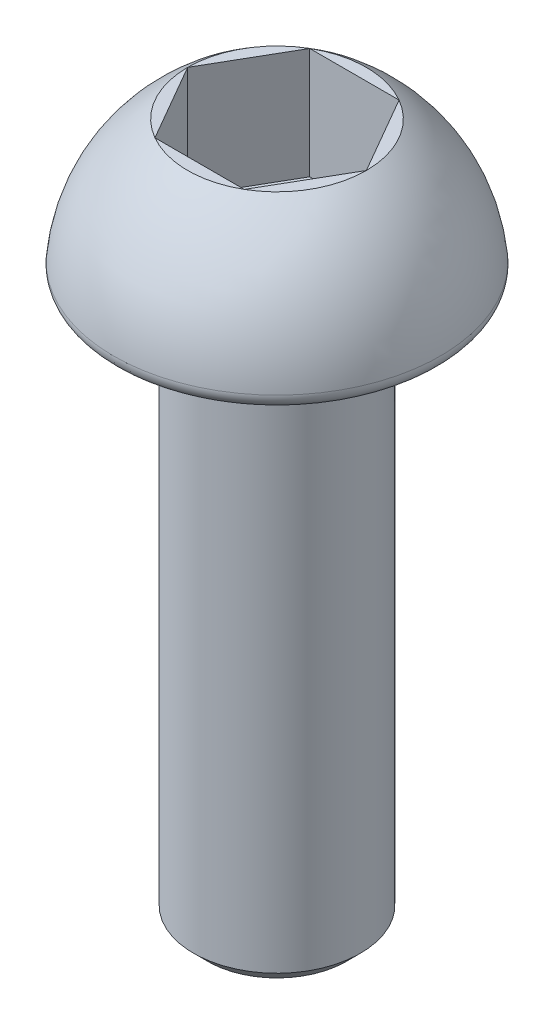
ISO-10303-21;
HEADER;
FILE_DESCRIPTION(('STEP AP214'),'2;1');
FILE_NAME('part.step','',(''),(''),'','','');
FILE_SCHEMA(('AUTOMOTIVE_DESIGN { 1 0 10303 214 1 1 1 1 }'));
ENDSEC;
DATA;
#1=APPLICATION_CONTEXT('core data for automotive mechanical design processes');
#2=APPLICATION_PROTOCOL_DEFINITION('international standard','automotive_design',2000,#1);
#3=PRODUCT_CONTEXT('',#1,'mechanical');
#4=PRODUCT('Part','Part','',(#3));
#5=PRODUCT_RELATED_PRODUCT_CATEGORY('part','',(#4));
#6=PRODUCT_DEFINITION_FORMATION('','',#4);
#7=PRODUCT_DEFINITION_CONTEXT('part definition',#1,'design');
#8=PRODUCT_DEFINITION('design','',#6,#7);
#9=PRODUCT_DEFINITION_SHAPE('','',#8);
#10=(LENGTH_UNIT() NAMED_UNIT(*) SI_UNIT(.MILLI.,.METRE.));
#11=(NAMED_UNIT(*) PLANE_ANGLE_UNIT() SI_UNIT($,.RADIAN.));
#12=(NAMED_UNIT(*) SI_UNIT($,.STERADIAN.) SOLID_ANGLE_UNIT());
#13=UNCERTAINTY_MEASURE_WITH_UNIT(LENGTH_MEASURE(1.E-05),#10,'distance_accuracy_value','');
#14=(GEOMETRIC_REPRESENTATION_CONTEXT(3) GLOBAL_UNCERTAINTY_ASSIGNED_CONTEXT((#13)) GLOBAL_UNIT_ASSIGNED_CONTEXT((#10,
#11,#12)) REPRESENTATION_CONTEXT('',''));
#15=CARTESIAN_POINT('',(0.,0.,0.));
#16=DIRECTION('',(0.,0.,1.));
#17=DIRECTION('',(1.,0.,0.));
#18=AXIS2_PLACEMENT_3D('',#15,#16,#17);
#19=CARTESIAN_POINT('',(3.21497695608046,48.7085687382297,0.));
#20=DIRECTION('',(0.,1.,0.));
#21=DIRECTION('',(0.,0.,1.));
#22=AXIS2_PLACEMENT_3D('',#19,#20,#21);
#23=PLANE('',#22);
#24=DIRECTION('',(-0.499999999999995,0.,-0.866025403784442));
#25=VECTOR('',#24,1.);
#26=CARTESIAN_POINT('',(1.60748847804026,48.7085687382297,-2.78425171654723));
#27=LINE('',#26,#25);
#28=CARTESIAN_POINT('',(3.21497695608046,48.7085687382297,0.));
#29=VERTEX_POINT('',#28);
#30=CARTESIAN_POINT('',(1.60748847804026,48.7085687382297,-2.78425171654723));
#31=VERTEX_POINT('',#30);
#32=EDGE_CURVE('E47',#29,#31,#27,.T.);
#33=ORIENTED_EDGE('',*,*,#32,.F.);
#34=CARTESIAN_POINT('',(0.,48.7085687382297,0.));
#35=DIRECTION('',(0.,-1.,0.));
#36=DIRECTION('',(0.,0.,-1.));
#37=AXIS2_PLACEMENT_3D('',#34,#35,#36);
#38=CIRCLE('',#37,3.21497695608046);
#39=EDGE_CURVE('E121',#31,#29,#38,.T.);
#40=ORIENTED_EDGE('',*,*,#39,.F.);
#41=EDGE_LOOP('',(#33,#40));
#42=FACE_BOUND('',#41,.T.);
#43=ADVANCED_FACE('F32',(#42),#23,.T.);
#44=DIRECTION('',(0.500000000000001,0.,-0.866025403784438));
#45=VECTOR('',#44,1.);
#46=CARTESIAN_POINT('',(3.21497695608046,48.7085687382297,0.));
#47=LINE('',#46,#45);
#48=CARTESIAN_POINT('',(1.60748847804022,48.7085687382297,2.78425171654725));
#49=VERTEX_POINT('',#48);
#50=EDGE_CURVE('E192',#49,#29,#47,.T.);
#51=ORIENTED_EDGE('',*,*,#50,.F.);
#52=EDGE_CURVE('E131',#29,#49,#38,.T.);
#53=ORIENTED_EDGE('',*,*,#52,.F.);
#54=EDGE_LOOP('',(#51,#53));
#55=FACE_BOUND('',#54,.T.);
#56=ADVANCED_FACE('F156',(#55),#23,.T.);
#57=DIRECTION('',(1.,0.,0.));
#58=VECTOR('',#57,1.);
#59=CARTESIAN_POINT('',(1.60748847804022,48.7085687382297,2.78425171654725));
#60=LINE('',#59,#58);
#61=CARTESIAN_POINT('',(-1.60748847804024,48.7085687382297,2.78425171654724));
#62=VERTEX_POINT('',#61);
#63=EDGE_CURVE('E189',#62,#49,#60,.T.);
#64=ORIENTED_EDGE('',*,*,#63,.F.);
#65=EDGE_CURVE('E127',#49,#62,#38,.T.);
#66=ORIENTED_EDGE('',*,*,#65,.F.);
#67=EDGE_LOOP('',(#64,#66));
#68=FACE_BOUND('',#67,.T.);
#69=ADVANCED_FACE('F162',(#68),#23,.T.);
#70=DIRECTION('',(0.499999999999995,0.,0.866025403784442));
#71=VECTOR('',#70,1.);
#72=CARTESIAN_POINT('',(-1.60748847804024,48.7085687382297,2.78425171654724));
#73=LINE('',#72,#71);
#74=CARTESIAN_POINT('',(-3.21497695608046,48.7085687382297,0.));
#75=VERTEX_POINT('',#74);
#76=EDGE_CURVE('E113',#75,#62,#73,.T.);
#77=ORIENTED_EDGE('',*,*,#76,.F.);
#78=EDGE_CURVE('E126',#62,#75,#38,.T.);
#79=ORIENTED_EDGE('',*,*,#78,.F.);
#80=EDGE_LOOP('',(#77,#79));
#81=FACE_BOUND('',#80,.T.);
#82=ADVANCED_FACE('F174',(#81),#23,.T.);
#83=DIRECTION('',(-0.500000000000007,0.,0.866025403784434));
#84=VECTOR('',#83,1.);
#85=CARTESIAN_POINT('',(-3.21497695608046,48.7085687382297,0.));
#86=LINE('',#85,#84);
#87=CARTESIAN_POINT('',(-1.60748847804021,48.7085687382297,-2.78425171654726));
#88=VERTEX_POINT('',#87);
#89=EDGE_CURVE('E90',#88,#75,#86,.T.);
#90=ORIENTED_EDGE('',*,*,#89,.F.);
#91=EDGE_CURVE('E111',#75,#88,#38,.T.);
#92=ORIENTED_EDGE('',*,*,#91,.F.);
#93=EDGE_LOOP('',(#90,#92));
#94=FACE_BOUND('',#93,.T.);
#95=ADVANCED_FACE('F109',(#94),#23,.T.);
#96=CARTESIAN_POINT('',(0.,0.,0.));
#97=DIRECTION('',(0.,-1.,0.));
#98=DIRECTION('',(0.,0.,-1.));
#99=AXIS2_PLACEMENT_3D('',#96,#97,#98);
#100=CYLINDRICAL_SURFACE('',#99,3.);
#101=CARTESIAN_POINT('',(0.,24.2085687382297,0.));
#102=DIRECTION('',(0.,-1.,0.));
#103=DIRECTION('',(0.,0.,-1.));
#104=AXIS2_PLACEMENT_3D('',#101,#102,#103);
#105=CIRCLE('',#104,3.);
#106=CARTESIAN_POINT('',(0.,24.2085687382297,-3.));
#107=VERTEX_POINT('',#106);
#108=EDGE_CURVE('E11',#107,#107,#105,.F.);
#109=ORIENTED_EDGE('',*,*,#108,.T.);
#110=EDGE_LOOP('',(#109));
#111=FACE_BOUND('',#110,.T.);
#112=CARTESIAN_POINT('',(0.,43.7085687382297,0.));
#113=DIRECTION('',(0.,-1.,0.));
#114=DIRECTION('',(0.,0.,-1.));
#115=AXIS2_PLACEMENT_3D('',#112,#113,#114);
#116=CIRCLE('',#115,3.);
#117=CARTESIAN_POINT('',(0.,43.7085687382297,-3.));
#118=VERTEX_POINT('',#117);
#119=EDGE_CURVE('E137',#118,#118,#116,.T.);
#120=ORIENTED_EDGE('',*,*,#119,.T.);
#121=EDGE_LOOP('',(#120));
#122=FACE_BOUND('',#121,.T.);
#123=ADVANCED_FACE('F34',(#111,#122),#100,.T.);
#124=CARTESIAN_POINT('',(5.37557774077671,43.7085687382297,0.));
#125=DIRECTION('',(0.,-1.,0.));
#126=DIRECTION('',(0.,0.,-1.));
#127=AXIS2_PLACEMENT_3D('',#124,#125,#126);
#128=PLANE('',#127);
#129=CARTESIAN_POINT('',(0.,43.7085687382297,0.));
#130=DIRECTION('',(0.,-1.,0.));
#131=DIRECTION('',(0.,0.,-1.));
#132=AXIS2_PLACEMENT_3D('',#129,#130,#131);
#133=CIRCLE('',#132,5.37557774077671);
#134=CARTESIAN_POINT('',(0.,43.7085687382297,-5.37557774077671));
#135=VERTEX_POINT('',#134);
#136=EDGE_CURVE('E134',#135,#135,#133,.T.);
#137=ORIENTED_EDGE('',*,*,#136,.T.);
#138=EDGE_LOOP('',(#137));
#139=FACE_BOUND('',#138,.T.);
#140=ORIENTED_EDGE('',*,*,#119,.F.);
#141=EDGE_LOOP('',(#140));
#142=FACE_BOUND('',#141,.T.);
#143=ADVANCED_FACE('F179',(#139,#142),#128,.T.);
#144=CARTESIAN_POINT('',(0.,44.2085687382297,0.));
#145=DIRECTION('',(0.,-1.,0.));
#146=DIRECTION('',(0.,0.,-1.));
#147=AXIS2_PLACEMENT_3D('',#144,#145,#146);
#148=TOROIDAL_SURFACE('',#147,5.37557774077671,0.500000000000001);
#149=CARTESIAN_POINT('',(0.,44.2540232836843,0.));
#150=DIRECTION('',(0.,-1.,0.));
#151=DIRECTION('',(0.,0.,-1.));
#152=AXIS2_PLACEMENT_3D('',#149,#150,#151);
#153=CIRCLE('',#152,5.87350733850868);
#154=CARTESIAN_POINT('',(0.,44.2540232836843,-5.87350733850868));
#155=VERTEX_POINT('',#154);
#156=EDGE_CURVE('E130',#155,#155,#153,.T.);
#157=ORIENTED_EDGE('',*,*,#156,.T.);
#158=EDGE_LOOP('',(#157));
#159=FACE_BOUND('',#158,.T.);
#160=ORIENTED_EDGE('',*,*,#136,.F.);
#161=EDGE_LOOP('',(#160));
#162=FACE_BOUND('',#161,.T.);
#163=ADVANCED_FACE('F172',(#159,#162),#148,.T.);
#164=CARTESIAN_POINT('',(0.,43.7085687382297,0.));
#165=DIRECTION('',(0.,-1.,0.));
#166=DIRECTION('',(0.,0.,-1.));
#167=AXIS2_PLACEMENT_3D('',#164,#165,#166);
#168=DEGENERATE_TOROIDAL_SURFACE('',#167,0.101647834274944,6.,.F.);
#169=ORIENTED_EDGE('',*,*,#39,.T.);
#170=ORIENTED_EDGE('',*,*,#52,.T.);
#171=ORIENTED_EDGE('',*,*,#65,.T.);
#172=ORIENTED_EDGE('',*,*,#78,.T.);
#173=ORIENTED_EDGE('',*,*,#91,.T.);
#174=EDGE_CURVE('E115',#88,#31,#38,.T.);
#175=ORIENTED_EDGE('',*,*,#174,.T.);
#176=EDGE_LOOP('',(#169,#170,#171,#172,#173,#175));
#177=FACE_BOUND('',#176,.T.);
#178=ORIENTED_EDGE('',*,*,#156,.F.);
#179=EDGE_LOOP('',(#178));
#180=FACE_BOUND('',#179,.T.);
#181=ADVANCED_FACE('F122',(#177,#180),#168,.F.);
#182=DIRECTION('',(-1.,0.,0.));
#183=VECTOR('',#182,1.);
#184=CARTESIAN_POINT('',(-1.60748847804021,48.7085687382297,-2.78425171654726));
#185=LINE('',#184,#183);
#186=EDGE_CURVE('E101',#31,#88,#185,.T.);
#187=ORIENTED_EDGE('',*,*,#186,.F.);
#188=ORIENTED_EDGE('',*,*,#174,.F.);
#189=EDGE_LOOP('',(#187,#188));
#190=FACE_BOUND('',#189,.T.);
#191=ADVANCED_FACE('F116',(#190),#23,.T.);
#192=CARTESIAN_POINT('',(3.,23.7085687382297,0.));
#193=DIRECTION('',(0.,-1.,0.));
#194=DIRECTION('',(0.,0.,-1.));
#195=AXIS2_PLACEMENT_3D('',#192,#193,#194);
#196=PLANE('',#195);
#197=CARTESIAN_POINT('',(0.,23.7085687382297,0.));
#198=DIRECTION('',(0.,-1.,0.));
#199=DIRECTION('',(0.,0.,-1.));
#200=AXIS2_PLACEMENT_3D('',#197,#198,#199);
#201=CIRCLE('',#200,2.50000000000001);
#202=CARTESIAN_POINT('',(0.,23.7085687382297,-2.50000000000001));
#203=VERTEX_POINT('',#202);
#204=EDGE_CURVE('E40',#203,#203,#201,.T.);
#205=ORIENTED_EDGE('',*,*,#204,.T.);
#206=EDGE_LOOP('',(#205));
#207=FACE_BOUND('',#206,.T.);
#208=ADVANCED_FACE('F142',(#207),#196,.T.);
#209=CARTESIAN_POINT('',(1.60748847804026,44.7085687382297,-2.78425171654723));
#210=DIRECTION('',(0.866025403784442,0.,-0.499999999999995));
#211=DIRECTION('',(-0.499999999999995,0.,-0.866025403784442));
#212=AXIS2_PLACEMENT_3D('',#209,#210,#211);
#213=PLANE('',#212);
#214=ORIENTED_EDGE('',*,*,#32,.T.);
#215=DIRECTION('',(0.,1.,0.));
#216=VECTOR('',#215,1.);
#217=CARTESIAN_POINT('',(1.60748847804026,44.7085687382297,-2.78425171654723));
#218=LINE('',#217,#216);
#219=CARTESIAN_POINT('',(1.60748847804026,44.7085687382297,-2.78425171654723));
#220=VERTEX_POINT('',#219);
#221=EDGE_CURVE('E98',#220,#31,#218,.T.);
#222=ORIENTED_EDGE('',*,*,#221,.F.);
#223=DIRECTION('',(-0.499999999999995,0.,-0.866025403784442));
#224=VECTOR('',#223,1.);
#225=CARTESIAN_POINT('',(1.60748847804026,44.7085687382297,-2.78425171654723));
#226=LINE('',#225,#224);
#227=CARTESIAN_POINT('',(3.21497695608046,44.7085687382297,0.));
#228=VERTEX_POINT('',#227);
#229=EDGE_CURVE('E196',#228,#220,#226,.T.);
#230=ORIENTED_EDGE('',*,*,#229,.F.);
#231=DIRECTION('',(0.,1.,0.));
#232=VECTOR('',#231,1.);
#233=CARTESIAN_POINT('',(3.21497695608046,44.7085687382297,0.));
#234=LINE('',#233,#232);
#235=EDGE_CURVE('E54',#228,#29,#234,.T.);
#236=ORIENTED_EDGE('',*,*,#235,.T.);
#237=EDGE_LOOP('',(#214,#222,#230,#236));
#238=FACE_BOUND('',#237,.T.);
#239=ADVANCED_FACE('F171',(#238),#213,.F.);
#240=CARTESIAN_POINT('',(3.21497695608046,44.7085687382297,0.));
#241=DIRECTION('',(0.866025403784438,0.,0.500000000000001));
#242=DIRECTION('',(0.500000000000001,0.,-0.866025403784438));
#243=AXIS2_PLACEMENT_3D('',#240,#241,#242);
#244=PLANE('',#243);
#245=ORIENTED_EDGE('',*,*,#50,.T.);
#246=ORIENTED_EDGE('',*,*,#235,.F.);
#247=DIRECTION('',(0.500000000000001,0.,-0.866025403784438));
#248=VECTOR('',#247,1.);
#249=CARTESIAN_POINT('',(3.21497695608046,44.7085687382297,0.));
#250=LINE('',#249,#248);
#251=CARTESIAN_POINT('',(1.60748847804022,44.7085687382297,2.78425171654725));
#252=VERTEX_POINT('',#251);
#253=EDGE_CURVE('E208',#252,#228,#250,.T.);
#254=ORIENTED_EDGE('',*,*,#253,.F.);
#255=DIRECTION('',(0.,1.,0.));
#256=VECTOR('',#255,1.);
#257=CARTESIAN_POINT('',(1.60748847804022,44.7085687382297,2.78425171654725));
#258=LINE('',#257,#256);
#259=EDGE_CURVE('E212',#252,#49,#258,.T.);
#260=ORIENTED_EDGE('',*,*,#259,.T.);
#261=EDGE_LOOP('',(#245,#246,#254,#260));
#262=FACE_BOUND('',#261,.T.);
#263=ADVANCED_FACE('F220',(#262),#244,.F.);
#264=CARTESIAN_POINT('',(1.60748847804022,44.7085687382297,2.78425171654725));
#265=DIRECTION('',(0.,0.,1.));
#266=DIRECTION('',(1.,0.,0.));
#267=AXIS2_PLACEMENT_3D('',#264,#265,#266);
#268=PLANE('',#267);
#269=ORIENTED_EDGE('',*,*,#63,.T.);
#270=ORIENTED_EDGE('',*,*,#259,.F.);
#271=DIRECTION('',(1.,0.,0.));
#272=VECTOR('',#271,1.);
#273=CARTESIAN_POINT('',(1.60748847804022,44.7085687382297,2.78425171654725));
#274=LINE('',#273,#272);
#275=CARTESIAN_POINT('',(-1.60748847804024,44.7085687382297,2.78425171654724));
#276=VERTEX_POINT('',#275);
#277=EDGE_CURVE('E205',#276,#252,#274,.T.);
#278=ORIENTED_EDGE('',*,*,#277,.F.);
#279=DIRECTION('',(0.,1.,0.));
#280=VECTOR('',#279,1.);
#281=CARTESIAN_POINT('',(-1.60748847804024,44.7085687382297,2.78425171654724));
#282=LINE('',#281,#280);
#283=EDGE_CURVE('E214',#276,#62,#282,.T.);
#284=ORIENTED_EDGE('',*,*,#283,.T.);
#285=EDGE_LOOP('',(#269,#270,#278,#284));
#286=FACE_BOUND('',#285,.T.);
#287=ADVANCED_FACE('F226',(#286),#268,.F.);
#288=CARTESIAN_POINT('',(-1.60748847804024,44.7085687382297,2.78425171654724));
#289=DIRECTION('',(-0.866025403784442,0.,0.499999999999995));
#290=DIRECTION('',(0.499999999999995,0.,0.866025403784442));
#291=AXIS2_PLACEMENT_3D('',#288,#289,#290);
#292=PLANE('',#291);
#293=ORIENTED_EDGE('',*,*,#76,.T.);
#294=ORIENTED_EDGE('',*,*,#283,.F.);
#295=DIRECTION('',(0.499999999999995,0.,0.866025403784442));
#296=VECTOR('',#295,1.);
#297=CARTESIAN_POINT('',(-1.60748847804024,44.7085687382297,2.78425171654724));
#298=LINE('',#297,#296);
#299=CARTESIAN_POINT('',(-3.21497695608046,44.7085687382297,0.));
#300=VERTEX_POINT('',#299);
#301=EDGE_CURVE('E202',#300,#276,#298,.T.);
#302=ORIENTED_EDGE('',*,*,#301,.F.);
#303=DIRECTION('',(0.,1.,0.));
#304=VECTOR('',#303,1.);
#305=CARTESIAN_POINT('',(-3.21497695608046,44.7085687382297,0.));
#306=LINE('',#305,#304);
#307=EDGE_CURVE('E97',#300,#75,#306,.T.);
#308=ORIENTED_EDGE('',*,*,#307,.T.);
#309=EDGE_LOOP('',(#293,#294,#302,#308));
#310=FACE_BOUND('',#309,.T.);
#311=ADVANCED_FACE('F217',(#310),#292,.F.);
#312=CARTESIAN_POINT('',(-3.21497695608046,44.7085687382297,0.));
#313=DIRECTION('',(-0.866025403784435,0.,-0.500000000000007));
#314=DIRECTION('',(-0.500000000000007,0.,0.866025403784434));
#315=AXIS2_PLACEMENT_3D('',#312,#313,#314);
#316=PLANE('',#315);
#317=ORIENTED_EDGE('',*,*,#89,.T.);
#318=ORIENTED_EDGE('',*,*,#307,.F.);
#319=DIRECTION('',(-0.500000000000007,0.,0.866025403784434));
#320=VECTOR('',#319,1.);
#321=CARTESIAN_POINT('',(-3.21497695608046,44.7085687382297,0.));
#322=LINE('',#321,#320);
#323=CARTESIAN_POINT('',(-1.60748847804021,44.7085687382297,-2.78425171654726));
#324=VERTEX_POINT('',#323);
#325=EDGE_CURVE('E93',#324,#300,#322,.T.);
#326=ORIENTED_EDGE('',*,*,#325,.F.);
#327=DIRECTION('',(0.,1.,0.));
#328=VECTOR('',#327,1.);
#329=CARTESIAN_POINT('',(-1.60748847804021,44.7085687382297,-2.78425171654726));
#330=LINE('',#329,#328);
#331=EDGE_CURVE('E86',#324,#88,#330,.T.);
#332=ORIENTED_EDGE('',*,*,#331,.T.);
#333=EDGE_LOOP('',(#317,#318,#326,#332));
#334=FACE_BOUND('',#333,.T.);
#335=ADVANCED_FACE('F88',(#334),#316,.F.);
#336=CARTESIAN_POINT('',(-1.60748847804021,44.7085687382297,-2.78425171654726));
#337=DIRECTION('',(0.,0.,-1.));
#338=DIRECTION('',(-1.,0.,0.));
#339=AXIS2_PLACEMENT_3D('',#336,#337,#338);
#340=PLANE('',#339);
#341=ORIENTED_EDGE('',*,*,#186,.T.);
#342=ORIENTED_EDGE('',*,*,#331,.F.);
#343=DIRECTION('',(-1.,0.,0.));
#344=VECTOR('',#343,1.);
#345=CARTESIAN_POINT('',(-1.60748847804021,44.7085687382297,-2.78425171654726));
#346=LINE('',#345,#344);
#347=EDGE_CURVE('E199',#220,#324,#346,.T.);
#348=ORIENTED_EDGE('',*,*,#347,.F.);
#349=ORIENTED_EDGE('',*,*,#221,.T.);
#350=EDGE_LOOP('',(#341,#342,#348,#349));
#351=FACE_BOUND('',#350,.T.);
#352=ADVANCED_FACE('F102',(#351),#340,.F.);
#353=CARTESIAN_POINT('',(4.82246543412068,44.7085687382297,2.78425171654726));
#354=DIRECTION('',(0.,-1.,0.));
#355=DIRECTION('',(0.,0.,-1.));
#356=AXIS2_PLACEMENT_3D('',#353,#354,#355);
#357=PLANE('',#356);
#358=ORIENTED_EDGE('',*,*,#229,.T.);
#359=ORIENTED_EDGE('',*,*,#347,.T.);
#360=ORIENTED_EDGE('',*,*,#325,.T.);
#361=ORIENTED_EDGE('',*,*,#301,.T.);
#362=ORIENTED_EDGE('',*,*,#277,.T.);
#363=ORIENTED_EDGE('',*,*,#253,.T.);
#364=EDGE_LOOP('',(#358,#359,#360,#361,#362,#363));
#365=FACE_BOUND('',#364,.T.);
#366=ADVANCED_FACE('F146',(#365),#357,.F.);
#367=CARTESIAN_POINT('',(0.,23.7085687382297,0.));
#368=DIRECTION('',(0.,1.,0.));
#369=DIRECTION('',(0.,0.,1.));
#370=AXIS2_PLACEMENT_3D('',#367,#368,#369);
#371=CONICAL_SURFACE('',#370,2.50000000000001,0.785398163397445);
#372=ORIENTED_EDGE('',*,*,#108,.F.);
#373=EDGE_LOOP('',(#372));
#374=FACE_BOUND('',#373,.T.);
#375=ORIENTED_EDGE('',*,*,#204,.F.);
#376=EDGE_LOOP('',(#375));
#377=FACE_BOUND('',#376,.T.);
#378=ADVANCED_FACE('F144',(#374,#377),#371,.T.);
#379=CLOSED_SHELL('',(#43,#56,#69,#82,#95,#123,#143,#163,#181,#191,#208,#239,#263,#287,#311,
#335,#352,#366,#378));
#380=MANIFOLD_SOLID_BREP('B2',#379);
#381=ADVANCED_BREP_SHAPE_REPRESENTATION('',(#18,#380),#14);
#382=SHAPE_DEFINITION_REPRESENTATION(#9,#381);
ENDSEC;
END-ISO-10303-21;
